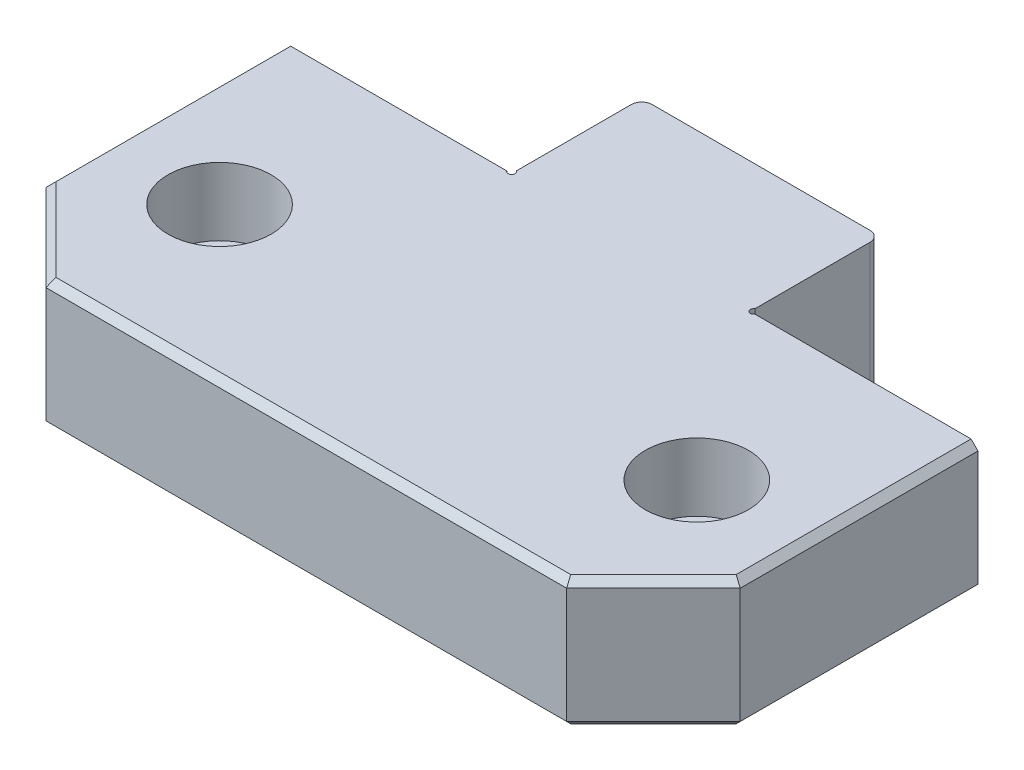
ISO-10303-21;
HEADER;
FILE_DESCRIPTION(('STEP AP214'),'2;1');
FILE_NAME('part.step','',(''),(''),'','','');
FILE_SCHEMA(('AUTOMOTIVE_DESIGN { 1 0 10303 214 1 1 1 1 }'));
ENDSEC;
DATA;
#1=APPLICATION_CONTEXT('core data for automotive mechanical design processes');
#2=APPLICATION_PROTOCOL_DEFINITION('international standard','automotive_design',2000,#1);
#3=PRODUCT_CONTEXT('',#1,'mechanical');
#4=PRODUCT('Part','Part','',(#3));
#5=PRODUCT_RELATED_PRODUCT_CATEGORY('part','',(#4));
#6=PRODUCT_DEFINITION_FORMATION('','',#4);
#7=PRODUCT_DEFINITION_CONTEXT('part definition',#1,'design');
#8=PRODUCT_DEFINITION('design','',#6,#7);
#9=PRODUCT_DEFINITION_SHAPE('','',#8);
#10=(LENGTH_UNIT() NAMED_UNIT(*) SI_UNIT(.MILLI.,.METRE.));
#11=(NAMED_UNIT(*) PLANE_ANGLE_UNIT() SI_UNIT($,.RADIAN.));
#12=(NAMED_UNIT(*) SI_UNIT($,.STERADIAN.) SOLID_ANGLE_UNIT());
#13=UNCERTAINTY_MEASURE_WITH_UNIT(LENGTH_MEASURE(1.E-05),#10,'distance_accuracy_value','');
#14=(GEOMETRIC_REPRESENTATION_CONTEXT(3) GLOBAL_UNCERTAINTY_ASSIGNED_CONTEXT((#13)) GLOBAL_UNIT_ASSIGNED_CONTEXT((#10,
#11,#12)) REPRESENTATION_CONTEXT('',''));
#15=CARTESIAN_POINT('',(0.,0.,0.));
#16=DIRECTION('',(0.,0.,1.));
#17=DIRECTION('',(1.,0.,0.));
#18=AXIS2_PLACEMENT_3D('',#15,#16,#17);
#19=CARTESIAN_POINT('',(-34.925,15.748,25.273));
#20=DIRECTION('',(0.,-1.,0.));
#21=DIRECTION('',(0.,0.,-1.));
#22=AXIS2_PLACEMENT_3D('',#19,#20,#21);
#23=CYLINDRICAL_SURFACE('',#22,5.1562);
#24=CARTESIAN_POINT('',(-34.925,0.,25.273));
#25=DIRECTION('',(0.,-1.,0.));
#26=DIRECTION('',(0.,0.,-1.));
#27=AXIS2_PLACEMENT_3D('',#24,#25,#26);
#28=CIRCLE('',#27,5.1562);
#29=CARTESIAN_POINT('',(-34.925,0.,20.1168));
#30=VERTEX_POINT('',#29);
#31=EDGE_CURVE('E250',#30,#30,#28,.T.);
#32=ORIENTED_EDGE('',*,*,#31,.T.);
#33=EDGE_LOOP('',(#32));
#34=FACE_BOUND('',#33,.T.);
#35=CARTESIAN_POINT('',(-34.925,8.9916,25.273));
#36=DIRECTION('',(0.,1.,0.));
#37=DIRECTION('',(0.,0.,1.));
#38=AXIS2_PLACEMENT_3D('',#35,#36,#37);
#39=CIRCLE('',#38,5.1562);
#40=CARTESIAN_POINT('',(-34.925,8.9916,30.4292));
#41=VERTEX_POINT('',#40);
#42=EDGE_CURVE('E252',#41,#41,#39,.F.);
#43=ORIENTED_EDGE('',*,*,#42,.F.);
#44=EDGE_LOOP('',(#43));
#45=FACE_BOUND('',#44,.T.);
#46=ADVANCED_FACE('F32',(#34,#45),#23,.F.);
#47=CARTESIAN_POINT('',(34.925,15.748,25.273));
#48=DIRECTION('',(0.,-1.,0.));
#49=DIRECTION('',(0.,0.,-1.));
#50=AXIS2_PLACEMENT_3D('',#47,#48,#49);
#51=CYLINDRICAL_SURFACE('',#50,5.1562);
#52=CARTESIAN_POINT('',(34.925,0.,25.273));
#53=DIRECTION('',(0.,-1.,0.));
#54=DIRECTION('',(0.,0.,-1.));
#55=AXIS2_PLACEMENT_3D('',#52,#53,#54);
#56=CIRCLE('',#55,5.1562);
#57=CARTESIAN_POINT('',(34.925,0.,20.1168));
#58=VERTEX_POINT('',#57);
#59=EDGE_CURVE('E210',#58,#58,#56,.T.);
#60=ORIENTED_EDGE('',*,*,#59,.T.);
#61=EDGE_LOOP('',(#60));
#62=FACE_BOUND('',#61,.T.);
#63=CARTESIAN_POINT('',(34.925,8.9916,25.273));
#64=DIRECTION('',(0.,1.,0.));
#65=DIRECTION('',(0.,0.,1.));
#66=AXIS2_PLACEMENT_3D('',#63,#64,#65);
#67=CIRCLE('',#66,5.1562);
#68=CARTESIAN_POINT('',(34.925,8.9916,30.4292));
#69=VERTEX_POINT('',#68);
#70=EDGE_CURVE('E247',#69,#69,#67,.F.);
#71=ORIENTED_EDGE('',*,*,#70,.F.);
#72=EDGE_LOOP('',(#71));
#73=FACE_BOUND('',#72,.T.);
#74=ADVANCED_FACE('F491',(#62,#73),#51,.F.);
#75=CARTESIAN_POINT('',(-50.8,18.923,47.498));
#76=DIRECTION('',(1.,0.,0.));
#77=DIRECTION('',(0.,0.,-1.));
#78=AXIS2_PLACEMENT_3D('',#75,#76,#77);
#79=PLANE('',#78);
#80=DIRECTION('',(0.,1.,0.));
#81=VECTOR('',#80,1.);
#82=CARTESIAN_POINT('',(-50.8,18.923,34.798));
#83=LINE('',#82,#81);
#84=CARTESIAN_POINT('',(-50.8,1.016,34.798));
#85=VERTEX_POINT('',#84);
#86=CARTESIAN_POINT('',(-50.8,17.907,34.798));
#87=VERTEX_POINT('',#86);
#88=EDGE_CURVE('E243',#85,#87,#83,.T.);
#89=ORIENTED_EDGE('',*,*,#88,.T.);
#90=DIRECTION('',(0.,0.,-1.));
#91=VECTOR('',#90,1.);
#92=CARTESIAN_POINT('',(-50.8,17.907,0.));
#93=LINE('',#92,#91);
#94=CARTESIAN_POINT('',(-50.8,17.907,0.));
#95=VERTEX_POINT('',#94);
#96=EDGE_CURVE('E284',#87,#95,#93,.T.);
#97=ORIENTED_EDGE('',*,*,#96,.T.);
#98=DIRECTION('',(0.,-1.,0.));
#99=VECTOR('',#98,1.);
#100=CARTESIAN_POINT('',(-50.8,18.923,0.));
#101=LINE('',#100,#99);
#102=CARTESIAN_POINT('',(-50.8,1.01600000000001,0.));
#103=VERTEX_POINT('',#102);
#104=EDGE_CURVE('E217',#95,#103,#101,.T.);
#105=ORIENTED_EDGE('',*,*,#104,.T.);
#106=DIRECTION('',(0.,0.,1.));
#107=VECTOR('',#106,1.);
#108=CARTESIAN_POINT('',(-50.8,1.016,47.498));
#109=LINE('',#108,#107);
#110=EDGE_CURVE('E281',#103,#85,#109,.T.);
#111=ORIENTED_EDGE('',*,*,#110,.T.);
#112=EDGE_LOOP('',(#89,#97,#105,#111));
#113=FACE_BOUND('',#112,.T.);
#114=ADVANCED_FACE('F388',(#113),#79,.F.);
#115=CARTESIAN_POINT('',(-50.8,18.923,47.498));
#116=DIRECTION('',(0.,0.,-1.));
#117=DIRECTION('',(-1.,0.,0.));
#118=AXIS2_PLACEMENT_3D('',#115,#116,#117);
#119=PLANE('',#118);
#120=DIRECTION('',(0.,1.,0.));
#121=VECTOR('',#120,1.);
#122=CARTESIAN_POINT('',(38.1,18.923,47.498));
#123=LINE('',#122,#121);
#124=CARTESIAN_POINT('',(38.1,1.016,47.498));
#125=VERTEX_POINT('',#124);
#126=CARTESIAN_POINT('',(38.1,17.907,47.498));
#127=VERTEX_POINT('',#126);
#128=EDGE_CURVE('E240',#125,#127,#123,.T.);
#129=ORIENTED_EDGE('',*,*,#128,.T.);
#130=DIRECTION('',(-1.,0.,0.));
#131=VECTOR('',#130,1.);
#132=CARTESIAN_POINT('',(-38.1,17.907,47.498));
#133=LINE('',#132,#131);
#134=CARTESIAN_POINT('',(-38.1,17.907,47.498));
#135=VERTEX_POINT('',#134);
#136=EDGE_CURVE('E308',#127,#135,#133,.T.);
#137=ORIENTED_EDGE('',*,*,#136,.T.);
#138=DIRECTION('',(0.,-1.,0.));
#139=VECTOR('',#138,1.);
#140=CARTESIAN_POINT('',(-38.1,18.923,47.498));
#141=LINE('',#140,#139);
#142=CARTESIAN_POINT('',(-38.1,1.016,47.498));
#143=VERTEX_POINT('',#142);
#144=EDGE_CURVE('E237',#135,#143,#141,.T.);
#145=ORIENTED_EDGE('',*,*,#144,.T.);
#146=DIRECTION('',(1.,0.,0.));
#147=VECTOR('',#146,1.);
#148=CARTESIAN_POINT('',(-50.8,1.016,47.498));
#149=LINE('',#148,#147);
#150=EDGE_CURVE('E306',#143,#125,#149,.T.);
#151=ORIENTED_EDGE('',*,*,#150,.T.);
#152=EDGE_LOOP('',(#129,#137,#145,#151));
#153=FACE_BOUND('',#152,.T.);
#154=ADVANCED_FACE('F367',(#153),#119,.F.);
#155=CARTESIAN_POINT('',(50.8,18.923,47.498));
#156=DIRECTION('',(-1.,0.,0.));
#157=DIRECTION('',(0.,0.,1.));
#158=AXIS2_PLACEMENT_3D('',#155,#156,#157);
#159=PLANE('',#158);
#160=DIRECTION('',(0.,-1.,0.));
#161=VECTOR('',#160,1.);
#162=CARTESIAN_POINT('',(50.8,18.923,0.));
#163=LINE('',#162,#161);
#164=CARTESIAN_POINT('',(50.8,17.907,0.));
#165=VERTEX_POINT('',#164);
#166=CARTESIAN_POINT('',(50.8,1.01600000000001,0.));
#167=VERTEX_POINT('',#166);
#168=EDGE_CURVE('E231',#165,#167,#163,.T.);
#169=ORIENTED_EDGE('',*,*,#168,.F.);
#170=DIRECTION('',(0.,0.,1.));
#171=VECTOR('',#170,1.);
#172=CARTESIAN_POINT('',(50.8,17.907,34.798));
#173=LINE('',#172,#171);
#174=CARTESIAN_POINT('',(50.8,17.907,34.798));
#175=VERTEX_POINT('',#174);
#176=EDGE_CURVE('E300',#165,#175,#173,.T.);
#177=ORIENTED_EDGE('',*,*,#176,.T.);
#178=DIRECTION('',(0.,-1.,0.));
#179=VECTOR('',#178,1.);
#180=CARTESIAN_POINT('',(50.8,18.923,34.798));
#181=LINE('',#180,#179);
#182=CARTESIAN_POINT('',(50.8,1.016,34.798));
#183=VERTEX_POINT('',#182);
#184=EDGE_CURVE('E234',#175,#183,#181,.T.);
#185=ORIENTED_EDGE('',*,*,#184,.T.);
#186=DIRECTION('',(0.,0.,-1.));
#187=VECTOR('',#186,1.);
#188=CARTESIAN_POINT('',(50.8,1.016,47.498));
#189=LINE('',#188,#187);
#190=EDGE_CURVE('E298',#183,#167,#189,.T.);
#191=ORIENTED_EDGE('',*,*,#190,.T.);
#192=EDGE_LOOP('',(#169,#177,#185,#191));
#193=FACE_BOUND('',#192,.T.);
#194=ADVANCED_FACE('F350',(#193),#159,.F.);
#195=CARTESIAN_POINT('',(18.1486919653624,18.923,0.));
#196=DIRECTION('',(0.,0.,1.));
#197=DIRECTION('',(1.,0.,0.));
#198=AXIS2_PLACEMENT_3D('',#195,#196,#197);
#199=PLANE('',#198);
#200=DIRECTION('',(-1.,0.,0.));
#201=VECTOR('',#200,1.);
#202=CARTESIAN_POINT('',(18.1486919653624,18.923,0.));
#203=LINE('',#202,#201);
#204=CARTESIAN_POINT('',(49.784,18.923,0.));
#205=VERTEX_POINT('',#204);
#206=CARTESIAN_POINT('',(18.1486919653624,18.923,0.));
#207=VERTEX_POINT('',#206);
#208=EDGE_CURVE('E216',#205,#207,#203,.T.);
#209=ORIENTED_EDGE('',*,*,#208,.F.);
#210=DIRECTION('',(0.707106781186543,-0.707106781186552,0.));
#211=VECTOR('',#210,1.);
#212=CARTESIAN_POINT('',(49.784,18.923,0.));
#213=LINE('',#212,#211);
#214=EDGE_CURVE('E296',#205,#165,#213,.T.);
#215=ORIENTED_EDGE('',*,*,#214,.T.);
#216=ORIENTED_EDGE('',*,*,#168,.T.);
#217=DIRECTION('',(0.707106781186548,0.707106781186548,0.));
#218=VECTOR('',#217,1.);
#219=CARTESIAN_POINT('',(50.8,1.016,0.));
#220=LINE('',#219,#218);
#221=CARTESIAN_POINT('',(49.784,0.,0.));
#222=VERTEX_POINT('',#221);
#223=EDGE_CURVE('E294',#167,#222,#220,.F.);
#224=ORIENTED_EDGE('',*,*,#223,.T.);
#225=DIRECTION('',(-1.,0.,0.));
#226=VECTOR('',#225,1.);
#227=CARTESIAN_POINT('',(18.1486919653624,0.,0.));
#228=LINE('',#227,#226);
#229=CARTESIAN_POINT('',(18.1486919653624,0.,0.));
#230=VERTEX_POINT('',#229);
#231=EDGE_CURVE('E206',#222,#230,#228,.T.);
#232=ORIENTED_EDGE('',*,*,#231,.T.);
#233=DIRECTION('',(0.,-1.,0.));
#234=VECTOR('',#233,1.);
#235=CARTESIAN_POINT('',(18.1486919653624,18.923,0.));
#236=LINE('',#235,#234);
#237=EDGE_CURVE('E205',#207,#230,#236,.T.);
#238=ORIENTED_EDGE('',*,*,#237,.F.);
#239=EDGE_LOOP('',(#209,#215,#216,#224,#232,#238));
#240=FACE_BOUND('',#239,.T.);
#241=ADVANCED_FACE('F355',(#240),#199,.F.);
#242=CARTESIAN_POINT('',(17.7165,18.923,-0.254));
#243=DIRECTION('',(0.,-1.,0.));
#244=DIRECTION('',(0.,0.,-1.));
#245=AXIS2_PLACEMENT_3D('',#242,#243,#244);
#246=CYLINDRICAL_SURFACE('',#245,0.50130419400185);
#247=CARTESIAN_POINT('',(17.7165,0.,-0.254));
#248=DIRECTION('',(0.,-1.,0.));
#249=DIRECTION('',(0.,0.,1.));
#250=AXIS2_PLACEMENT_3D('',#247,#248,#249);
#251=CIRCLE('',#250,0.50130419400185);
#252=CARTESIAN_POINT('',(17.2843080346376,0.,0.));
#253=VERTEX_POINT('',#252);
#254=EDGE_CURVE('E197',#230,#253,#251,.T.);
#255=ORIENTED_EDGE('',*,*,#254,.T.);
#256=DIRECTION('',(0.,-1.,0.));
#257=VECTOR('',#256,1.);
#258=CARTESIAN_POINT('',(17.2843080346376,18.923,0.));
#259=LINE('',#258,#257);
#260=CARTESIAN_POINT('',(17.2843080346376,0.254000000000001,0.));
#261=VERTEX_POINT('',#260);
#262=EDGE_CURVE('E180',#253,#261,#259,.F.);
#263=ORIENTED_EDGE('',*,*,#262,.T.);
#264=CARTESIAN_POINT('',(17.7165,0.254000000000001,-0.254));
#265=DIRECTION('',(0.,1.,0.));
#266=DIRECTION('',(0.,0.,1.));
#267=AXIS2_PLACEMENT_3D('',#264,#265,#266);
#268=CIRCLE('',#267,0.50130419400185);
#269=CARTESIAN_POINT('',(17.4625,0.254,-0.686191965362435));
#270=VERTEX_POINT('',#269);
#271=EDGE_CURVE('E431',#261,#270,#268,.F.);
#272=ORIENTED_EDGE('',*,*,#271,.T.);
#273=DIRECTION('',(0.,-1.,0.));
#274=VECTOR('',#273,1.);
#275=CARTESIAN_POINT('',(17.4625,18.923,-0.686191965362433));
#276=LINE('',#275,#274);
#277=CARTESIAN_POINT('',(17.4625,18.923,-0.686191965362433));
#278=VERTEX_POINT('',#277);
#279=EDGE_CURVE('E227',#278,#270,#276,.T.);
#280=ORIENTED_EDGE('',*,*,#279,.F.);
#281=CARTESIAN_POINT('',(17.7165,18.923,-0.254));
#282=DIRECTION('',(0.,-1.,0.));
#283=DIRECTION('',(0.,0.,1.));
#284=AXIS2_PLACEMENT_3D('',#281,#282,#283);
#285=CIRCLE('',#284,0.50130419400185);
#286=EDGE_CURVE('E415',#207,#278,#285,.T.);
#287=ORIENTED_EDGE('',*,*,#286,.F.);
#288=ORIENTED_EDGE('',*,*,#237,.T.);
#289=EDGE_LOOP('',(#255,#263,#272,#280,#287,#288));
#290=FACE_BOUND('',#289,.T.);
#291=ADVANCED_FACE('F202',(#290),#246,.F.);
#292=CARTESIAN_POINT('',(17.4625,18.923,-19.05));
#293=DIRECTION('',(-1.,0.,0.));
#294=DIRECTION('',(0.,0.,1.));
#295=AXIS2_PLACEMENT_3D('',#292,#293,#294);
#296=PLANE('',#295);
#297=ORIENTED_EDGE('',*,*,#279,.T.);
#298=DIRECTION('',(0.,0.,1.));
#299=VECTOR('',#298,1.);
#300=CARTESIAN_POINT('',(17.4625,0.254,0.));
#301=LINE('',#300,#299);
#302=CARTESIAN_POINT('',(17.4625,0.254000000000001,-17.526));
#303=VERTEX_POINT('',#302);
#304=EDGE_CURVE('E437',#303,#270,#301,.T.);
#305=ORIENTED_EDGE('',*,*,#304,.F.);
#306=DIRECTION('',(0.,-1.,0.));
#307=VECTOR('',#306,1.);
#308=CARTESIAN_POINT('',(17.4625,18.923,-17.526));
#309=LINE('',#308,#307);
#310=CARTESIAN_POINT('',(17.4625,18.923,-17.526));
#311=VERTEX_POINT('',#310);
#312=EDGE_CURVE('E268',#303,#311,#309,.F.);
#313=ORIENTED_EDGE('',*,*,#312,.T.);
#314=DIRECTION('',(0.,0.,-1.));
#315=VECTOR('',#314,1.);
#316=CARTESIAN_POINT('',(17.4625,18.923,-19.05));
#317=LINE('',#316,#315);
#318=EDGE_CURVE('E412',#278,#311,#317,.T.);
#319=ORIENTED_EDGE('',*,*,#318,.F.);
#320=EDGE_LOOP('',(#297,#305,#313,#319));
#321=FACE_BOUND('',#320,.T.);
#322=ADVANCED_FACE('F468',(#321),#296,.F.);
#323=CARTESIAN_POINT('',(-17.4625,18.923,-19.05));
#324=DIRECTION('',(0.,0.,1.));
#325=DIRECTION('',(1.,0.,0.));
#326=AXIS2_PLACEMENT_3D('',#323,#324,#325);
#327=PLANE('',#326);
#328=DIRECTION('',(0.,-1.,0.));
#329=VECTOR('',#328,1.);
#330=CARTESIAN_POINT('',(15.9385,18.923,-19.05));
#331=LINE('',#330,#329);
#332=CARTESIAN_POINT('',(15.9385,18.923,-19.05));
#333=VERTEX_POINT('',#332);
#334=CARTESIAN_POINT('',(15.9385,0.254000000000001,-19.05));
#335=VERTEX_POINT('',#334);
#336=EDGE_CURVE('E259',#333,#335,#331,.T.);
#337=ORIENTED_EDGE('',*,*,#336,.T.);
#338=DIRECTION('',(1.,0.,0.));
#339=VECTOR('',#338,1.);
#340=CARTESIAN_POINT('',(17.4625,0.254,-19.05));
#341=LINE('',#340,#339);
#342=CARTESIAN_POINT('',(-15.9385,0.254000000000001,-19.05));
#343=VERTEX_POINT('',#342);
#344=EDGE_CURVE('E46',#343,#335,#341,.T.);
#345=ORIENTED_EDGE('',*,*,#344,.F.);
#346=DIRECTION('',(0.,-1.,0.));
#347=VECTOR('',#346,1.);
#348=CARTESIAN_POINT('',(-15.9385,18.923,-19.05));
#349=LINE('',#348,#347);
#350=CARTESIAN_POINT('',(-15.9385,18.923,-19.05));
#351=VERTEX_POINT('',#350);
#352=EDGE_CURVE('E262',#343,#351,#349,.F.);
#353=ORIENTED_EDGE('',*,*,#352,.T.);
#354=DIRECTION('',(-1.,0.,0.));
#355=VECTOR('',#354,1.);
#356=CARTESIAN_POINT('',(-17.4625,18.923,-19.05));
#357=LINE('',#356,#355);
#358=EDGE_CURVE('E409',#333,#351,#357,.T.);
#359=ORIENTED_EDGE('',*,*,#358,.F.);
#360=EDGE_LOOP('',(#337,#345,#353,#359));
#361=FACE_BOUND('',#360,.T.);
#362=ADVANCED_FACE('F459',(#361),#327,.F.);
#363=CARTESIAN_POINT('',(-17.4625,18.923,-0.693940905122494));
#364=DIRECTION('',(1.,0.,0.));
#365=DIRECTION('',(0.,0.,-1.));
#366=AXIS2_PLACEMENT_3D('',#363,#364,#365);
#367=PLANE('',#366);
#368=DIRECTION('',(0.,-1.,0.));
#369=VECTOR('',#368,1.);
#370=CARTESIAN_POINT('',(-17.4625,18.923,-17.526));
#371=LINE('',#370,#369);
#372=CARTESIAN_POINT('',(-17.4625,18.923,-17.526));
#373=VERTEX_POINT('',#372);
#374=CARTESIAN_POINT('',(-17.4625,0.254000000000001,-17.526));
#375=VERTEX_POINT('',#374);
#376=EDGE_CURVE('E246',#373,#375,#371,.T.);
#377=ORIENTED_EDGE('',*,*,#376,.T.);
#378=DIRECTION('',(0.,0.,-1.));
#379=VECTOR('',#378,1.);
#380=CARTESIAN_POINT('',(-17.4625,0.254,-19.05));
#381=LINE('',#380,#379);
#382=CARTESIAN_POINT('',(-17.4625,0.254000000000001,-0.693940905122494));
#383=VERTEX_POINT('',#382);
#384=EDGE_CURVE('E441',#383,#375,#381,.T.);
#385=ORIENTED_EDGE('',*,*,#384,.F.);
#386=DIRECTION('',(0.,-1.,0.));
#387=VECTOR('',#386,1.);
#388=CARTESIAN_POINT('',(-17.4625,18.923,-0.693940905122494));
#389=LINE('',#388,#387);
#390=CARTESIAN_POINT('',(-17.4625,18.923,-0.693940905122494));
#391=VERTEX_POINT('',#390);
#392=EDGE_CURVE('E224',#391,#383,#389,.T.);
#393=ORIENTED_EDGE('',*,*,#392,.F.);
#394=DIRECTION('',(0.,0.,1.));
#395=VECTOR('',#394,1.);
#396=CARTESIAN_POINT('',(-17.4625,18.923,-0.693940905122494));
#397=LINE('',#396,#395);
#398=EDGE_CURVE('E405',#373,#391,#397,.T.);
#399=ORIENTED_EDGE('',*,*,#398,.F.);
#400=EDGE_LOOP('',(#377,#385,#393,#399));
#401=FACE_BOUND('',#400,.T.);
#402=ADVANCED_FACE('F450',(#401),#367,.F.);
#403=CARTESIAN_POINT('',(-17.7165,18.923,-0.254));
#404=DIRECTION('',(0.,-1.,0.));
#405=DIRECTION('',(0.,0.,-1.));
#406=AXIS2_PLACEMENT_3D('',#403,#404,#405);
#407=CYLINDRICAL_SURFACE('',#406,0.508);
#408=CARTESIAN_POINT('',(-17.7165,0.254000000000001,-0.254));
#409=DIRECTION('',(0.,1.,0.));
#410=DIRECTION('',(0.,0.,1.));
#411=AXIS2_PLACEMENT_3D('',#408,#409,#410);
#412=CIRCLE('',#411,0.508);
#413=CARTESIAN_POINT('',(-17.2765590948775,0.254000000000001,0.));
#414=VERTEX_POINT('',#413);
#415=EDGE_CURVE('E433',#383,#414,#412,.F.);
#416=ORIENTED_EDGE('',*,*,#415,.T.);
#417=DIRECTION('',(0.,-1.,0.));
#418=VECTOR('',#417,1.);
#419=CARTESIAN_POINT('',(-17.2765590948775,18.923,0.));
#420=LINE('',#419,#418);
#421=CARTESIAN_POINT('',(-17.2765590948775,0.,0.));
#422=VERTEX_POINT('',#421);
#423=EDGE_CURVE('E191',#414,#422,#420,.T.);
#424=ORIENTED_EDGE('',*,*,#423,.T.);
#425=CARTESIAN_POINT('',(-17.7165,0.,-0.254));
#426=DIRECTION('',(0.,-1.,0.));
#427=DIRECTION('',(0.,0.,1.));
#428=AXIS2_PLACEMENT_3D('',#425,#426,#427);
#429=CIRCLE('',#428,0.508);
#430=CARTESIAN_POINT('',(-18.1564409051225,0.,0.));
#431=VERTEX_POINT('',#430);
#432=EDGE_CURVE('E199',#422,#431,#429,.T.);
#433=ORIENTED_EDGE('',*,*,#432,.T.);
#434=DIRECTION('',(0.,-1.,0.));
#435=VECTOR('',#434,1.);
#436=CARTESIAN_POINT('',(-18.1564409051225,18.923,0.));
#437=LINE('',#436,#435);
#438=CARTESIAN_POINT('',(-18.1564409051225,18.923,0.));
#439=VERTEX_POINT('',#438);
#440=EDGE_CURVE('E220',#439,#431,#437,.T.);
#441=ORIENTED_EDGE('',*,*,#440,.F.);
#442=CARTESIAN_POINT('',(-17.7165,18.923,-0.254));
#443=DIRECTION('',(0.,-1.,0.));
#444=DIRECTION('',(0.,0.,1.));
#445=AXIS2_PLACEMENT_3D('',#442,#443,#444);
#446=CIRCLE('',#445,0.508);
#447=EDGE_CURVE('E403',#391,#439,#446,.T.);
#448=ORIENTED_EDGE('',*,*,#447,.F.);
#449=ORIENTED_EDGE('',*,*,#392,.T.);
#450=EDGE_LOOP('',(#416,#424,#433,#441,#448,#449));
#451=FACE_BOUND('',#450,.T.);
#452=ADVANCED_FACE('F446',(#451),#407,.F.);
#453=CARTESIAN_POINT('',(-50.8,18.923,0.));
#454=DIRECTION('',(0.,0.,1.));
#455=DIRECTION('',(1.,0.,0.));
#456=AXIS2_PLACEMENT_3D('',#453,#454,#455);
#457=PLANE('',#456);
#458=ORIENTED_EDGE('',*,*,#104,.F.);
#459=DIRECTION('',(0.707106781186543,0.707106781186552,0.));
#460=VECTOR('',#459,1.);
#461=CARTESIAN_POINT('',(-49.784,18.923,0.));
#462=LINE('',#461,#460);
#463=CARTESIAN_POINT('',(-49.784,18.923,0.));
#464=VERTEX_POINT('',#463);
#465=EDGE_CURVE('E288',#95,#464,#462,.T.);
#466=ORIENTED_EDGE('',*,*,#465,.T.);
#467=DIRECTION('',(-1.,0.,0.));
#468=VECTOR('',#467,1.);
#469=CARTESIAN_POINT('',(-50.8,18.923,0.));
#470=LINE('',#469,#468);
#471=EDGE_CURVE('E221',#439,#464,#470,.T.);
#472=ORIENTED_EDGE('',*,*,#471,.F.);
#473=ORIENTED_EDGE('',*,*,#440,.T.);
#474=DIRECTION('',(-1.,0.,0.));
#475=VECTOR('',#474,1.);
#476=CARTESIAN_POINT('',(-50.8,0.,0.));
#477=LINE('',#476,#475);
#478=CARTESIAN_POINT('',(-49.784,0.,0.));
#479=VERTEX_POINT('',#478);
#480=EDGE_CURVE('E208',#431,#479,#477,.T.);
#481=ORIENTED_EDGE('',*,*,#480,.T.);
#482=DIRECTION('',(0.707106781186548,-0.707106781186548,0.));
#483=VECTOR('',#482,1.);
#484=CARTESIAN_POINT('',(-50.8,1.016,0.));
#485=LINE('',#484,#483);
#486=EDGE_CURVE('E286',#479,#103,#485,.F.);
#487=ORIENTED_EDGE('',*,*,#486,.T.);
#488=EDGE_LOOP('',(#458,#466,#472,#473,#481,#487));
#489=FACE_BOUND('',#488,.T.);
#490=ADVANCED_FACE('F398',(#489),#457,.F.);
#491=CARTESIAN_POINT('',(-17.7165,18.923,-0.254));
#492=DIRECTION('',(0.,1.,0.));
#493=DIRECTION('',(0.,0.,1.));
#494=AXIS2_PLACEMENT_3D('',#491,#492,#493);
#495=PLANE('',#494);
#496=ORIENTED_EDGE('',*,*,#471,.T.);
#497=DIRECTION('',(0.,0.,1.));
#498=VECTOR('',#497,1.);
#499=CARTESIAN_POINT('',(-49.784,18.923,34.7979999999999));
#500=LINE('',#499,#498);
#501=CARTESIAN_POINT('',(-49.784,18.923,34.3771590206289));
#502=VERTEX_POINT('',#501);
#503=EDGE_CURVE('E278',#464,#502,#500,.T.);
#504=ORIENTED_EDGE('',*,*,#503,.T.);
#505=DIRECTION('',(0.707106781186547,0.,0.707106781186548));
#506=VECTOR('',#505,1.);
#507=CARTESIAN_POINT('',(-51.0658295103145,18.923,33.0953295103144));
#508=LINE('',#507,#506);
#509=CARTESIAN_POINT('',(-37.6791590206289,18.923,46.482));
#510=VERTEX_POINT('',#509);
#511=EDGE_CURVE('E276',#502,#510,#508,.T.);
#512=ORIENTED_EDGE('',*,*,#511,.T.);
#513=DIRECTION('',(1.,0.,0.));
#514=VECTOR('',#513,1.);
#515=CARTESIAN_POINT('',(38.0999999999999,18.923,46.482));
#516=LINE('',#515,#514);
#517=CARTESIAN_POINT('',(37.6791590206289,18.923,46.482));
#518=VERTEX_POINT('',#517);
#519=EDGE_CURVE('E270',#510,#518,#516,.T.);
#520=ORIENTED_EDGE('',*,*,#519,.T.);
#521=DIRECTION('',(0.707106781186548,0.,-0.707106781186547));
#522=VECTOR('',#521,1.);
#523=CARTESIAN_POINT('',(33.3493295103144,18.923,50.8118295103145));
#524=LINE('',#523,#522);
#525=CARTESIAN_POINT('',(49.784,18.923,34.3771590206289));
#526=VERTEX_POINT('',#525);
#527=EDGE_CURVE('E272',#518,#526,#524,.T.);
#528=ORIENTED_EDGE('',*,*,#527,.T.);
#529=DIRECTION('',(0.,0.,-1.));
#530=VECTOR('',#529,1.);
#531=CARTESIAN_POINT('',(49.784,18.923,0.));
#532=LINE('',#531,#530);
#533=EDGE_CURVE('E274',#526,#205,#532,.T.);
#534=ORIENTED_EDGE('',*,*,#533,.T.);
#535=ORIENTED_EDGE('',*,*,#208,.T.);
#536=ORIENTED_EDGE('',*,*,#286,.T.);
#537=ORIENTED_EDGE('',*,*,#318,.T.);
#538=CARTESIAN_POINT('',(15.9385,18.923,-17.526));
#539=DIRECTION('',(0.,1.,0.));
#540=DIRECTION('',(0.,0.,1.));
#541=AXIS2_PLACEMENT_3D('',#538,#539,#540);
#542=CIRCLE('',#541,1.524);
#543=EDGE_CURVE('E264',#311,#333,#542,.T.);
#544=ORIENTED_EDGE('',*,*,#543,.T.);
#545=ORIENTED_EDGE('',*,*,#358,.T.);
#546=CARTESIAN_POINT('',(-15.9385,18.923,-17.526));
#547=DIRECTION('',(0.,1.,0.));
#548=DIRECTION('',(0.,0.,1.));
#549=AXIS2_PLACEMENT_3D('',#546,#547,#548);
#550=CIRCLE('',#549,1.524);
#551=EDGE_CURVE('E266',#351,#373,#550,.T.);
#552=ORIENTED_EDGE('',*,*,#551,.T.);
#553=ORIENTED_EDGE('',*,*,#398,.T.);
#554=ORIENTED_EDGE('',*,*,#447,.T.);
#555=EDGE_LOOP('',(#496,#504,#512,#520,#528,#534,#535,#536,#537,#544,#545,#552,#553,#554));
#556=FACE_BOUND('',#555,.T.);
#557=CARTESIAN_POINT('',(-34.925,18.923,25.273));
#558=DIRECTION('',(0.,1.,0.));
#559=DIRECTION('',(0.,0.,1.));
#560=AXIS2_PLACEMENT_3D('',#557,#558,#559);
#561=CIRCLE('',#560,7.5438);
#562=CARTESIAN_POINT('',(-34.925,18.923,32.8168));
#563=VERTEX_POINT('',#562);
#564=EDGE_CURVE('E330',#563,#563,#561,.T.);
#565=ORIENTED_EDGE('',*,*,#564,.F.);
#566=EDGE_LOOP('',(#565));
#567=FACE_BOUND('',#566,.T.);
#568=CARTESIAN_POINT('',(34.925,18.923,25.273));
#569=DIRECTION('',(0.,1.,0.));
#570=DIRECTION('',(0.,0.,1.));
#571=AXIS2_PLACEMENT_3D('',#568,#569,#570);
#572=CIRCLE('',#571,7.54380000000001);
#573=CARTESIAN_POINT('',(34.925,18.923,32.8168));
#574=VERTEX_POINT('',#573);
#575=EDGE_CURVE('E255',#574,#574,#572,.T.);
#576=ORIENTED_EDGE('',*,*,#575,.F.);
#577=EDGE_LOOP('',(#576));
#578=FACE_BOUND('',#577,.T.);
#579=ADVANCED_FACE('F400',(#556,#567,#578),#495,.T.);
#580=CARTESIAN_POINT('',(-17.7165,0.,-0.254));
#581=DIRECTION('',(0.,1.,0.));
#582=DIRECTION('',(0.,0.,1.));
#583=AXIS2_PLACEMENT_3D('',#580,#581,#582);
#584=PLANE('',#583);
#585=ORIENTED_EDGE('',*,*,#31,.F.);
#586=EDGE_LOOP('',(#585));
#587=FACE_BOUND('',#586,.T.);
#588=ORIENTED_EDGE('',*,*,#59,.F.);
#589=EDGE_LOOP('',(#588));
#590=FACE_BOUND('',#589,.T.);
#591=ORIENTED_EDGE('',*,*,#432,.F.);
#592=DIRECTION('',(-1.,0.,0.));
#593=VECTOR('',#592,1.);
#594=CARTESIAN_POINT('',(17.4625,0.,0.));
#595=LINE('',#594,#593);
#596=EDGE_CURVE('E183',#253,#422,#595,.T.);
#597=ORIENTED_EDGE('',*,*,#596,.F.);
#598=ORIENTED_EDGE('',*,*,#254,.F.);
#599=ORIENTED_EDGE('',*,*,#231,.F.);
#600=DIRECTION('',(0.,0.,1.));
#601=VECTOR('',#600,1.);
#602=CARTESIAN_POINT('',(49.784,0.,-0.254));
#603=LINE('',#602,#601);
#604=CARTESIAN_POINT('',(49.784,0.,34.3771590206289));
#605=VERTEX_POINT('',#604);
#606=EDGE_CURVE('E310',#222,#605,#603,.T.);
#607=ORIENTED_EDGE('',*,*,#606,.T.);
#608=DIRECTION('',(-0.707106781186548,0.,0.707106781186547));
#609=VECTOR('',#608,1.);
#610=CARTESIAN_POINT('',(37.3815795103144,0.,46.7795795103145));
#611=LINE('',#610,#609);
#612=CARTESIAN_POINT('',(37.6791590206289,0.,46.482));
#613=VERTEX_POINT('',#612);
#614=EDGE_CURVE('E312',#605,#613,#611,.T.);
#615=ORIENTED_EDGE('',*,*,#614,.T.);
#616=DIRECTION('',(-1.,0.,0.));
#617=VECTOR('',#616,1.);
#618=CARTESIAN_POINT('',(-17.7165,0.,46.482));
#619=LINE('',#618,#617);
#620=CARTESIAN_POINT('',(-37.6791590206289,0.,46.482));
#621=VERTEX_POINT('',#620);
#622=EDGE_CURVE('E314',#613,#621,#619,.T.);
#623=ORIENTED_EDGE('',*,*,#622,.T.);
#624=DIRECTION('',(-0.707106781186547,0.,-0.707106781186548));
#625=VECTOR('',#624,1.);
#626=CARTESIAN_POINT('',(-50.0815795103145,0.,34.0795795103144));
#627=LINE('',#626,#625);
#628=CARTESIAN_POINT('',(-49.784,0.,34.3771590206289));
#629=VERTEX_POINT('',#628);
#630=EDGE_CURVE('E54',#621,#629,#627,.T.);
#631=ORIENTED_EDGE('',*,*,#630,.T.);
#632=DIRECTION('',(0.,0.,-1.));
#633=VECTOR('',#632,1.);
#634=CARTESIAN_POINT('',(-49.784,0.,-0.254));
#635=LINE('',#634,#633);
#636=EDGE_CURVE('E40',#629,#479,#635,.T.);
#637=ORIENTED_EDGE('',*,*,#636,.T.);
#638=ORIENTED_EDGE('',*,*,#480,.F.);
#639=EDGE_LOOP('',(#591,#597,#598,#599,#607,#615,#623,#631,#637,#638));
#640=FACE_BOUND('',#639,.T.);
#641=ADVANCED_FACE('F195',(#587,#590,#640),#584,.F.);
#642=CARTESIAN_POINT('',(50.8,18.923,34.798));
#643=DIRECTION('',(-0.707106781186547,0.,-0.707106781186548));
#644=DIRECTION('',(-0.707106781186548,0.,0.707106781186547));
#645=AXIS2_PLACEMENT_3D('',#642,#643,#644);
#646=PLANE('',#645);
#647=ORIENTED_EDGE('',*,*,#184,.F.);
#648=DIRECTION('',(0.707106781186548,0.,-0.707106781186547));
#649=VECTOR('',#648,1.);
#650=CARTESIAN_POINT('',(50.8,17.907,34.798));
#651=LINE('',#650,#649);
#652=EDGE_CURVE('E304',#175,#127,#651,.F.);
#653=ORIENTED_EDGE('',*,*,#652,.T.);
#654=ORIENTED_EDGE('',*,*,#128,.F.);
#655=DIRECTION('',(-0.707106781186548,0.,0.707106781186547));
#656=VECTOR('',#655,1.);
#657=CARTESIAN_POINT('',(50.8,1.016,34.798));
#658=LINE('',#657,#656);
#659=EDGE_CURVE('E302',#125,#183,#658,.F.);
#660=ORIENTED_EDGE('',*,*,#659,.T.);
#661=EDGE_LOOP('',(#647,#653,#654,#660));
#662=FACE_BOUND('',#661,.T.);
#663=ADVANCED_FACE('F363',(#662),#646,.F.);
#664=CARTESIAN_POINT('',(-38.1,18.923,47.498));
#665=DIRECTION('',(0.707106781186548,0.,-0.707106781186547));
#666=DIRECTION('',(-0.707106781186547,0.,-0.707106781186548));
#667=AXIS2_PLACEMENT_3D('',#664,#665,#666);
#668=PLANE('',#667);
#669=ORIENTED_EDGE('',*,*,#144,.F.);
#670=DIRECTION('',(0.707106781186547,0.,0.707106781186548));
#671=VECTOR('',#670,1.);
#672=CARTESIAN_POINT('',(-38.1,17.907,47.498));
#673=LINE('',#672,#671);
#674=EDGE_CURVE('E292',#135,#87,#673,.F.);
#675=ORIENTED_EDGE('',*,*,#674,.T.);
#676=ORIENTED_EDGE('',*,*,#88,.F.);
#677=DIRECTION('',(-0.707106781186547,0.,-0.707106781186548));
#678=VECTOR('',#677,1.);
#679=CARTESIAN_POINT('',(-38.1,1.016,47.498));
#680=LINE('',#679,#678);
#681=EDGE_CURVE('E290',#85,#143,#680,.F.);
#682=ORIENTED_EDGE('',*,*,#681,.T.);
#683=EDGE_LOOP('',(#669,#675,#676,#682));
#684=FACE_BOUND('',#683,.T.);
#685=ADVANCED_FACE('F385',(#684),#668,.F.);
#686=CARTESIAN_POINT('',(34.925,8.9916,25.273));
#687=DIRECTION('',(0.,1.,0.));
#688=DIRECTION('',(0.,0.,1.));
#689=AXIS2_PLACEMENT_3D('',#686,#687,#688);
#690=PLANE('',#689);
#691=CARTESIAN_POINT('',(34.925,8.9916,25.273));
#692=DIRECTION('',(0.,1.,0.));
#693=DIRECTION('',(0.,0.,1.));
#694=AXIS2_PLACEMENT_3D('',#691,#692,#693);
#695=CIRCLE('',#694,7.54380000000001);
#696=CARTESIAN_POINT('',(34.925,8.9916,32.8168));
#697=VERTEX_POINT('',#696);
#698=EDGE_CURVE('E251',#697,#697,#695,.T.);
#699=ORIENTED_EDGE('',*,*,#698,.T.);
#700=EDGE_LOOP('',(#699));
#701=FACE_BOUND('',#700,.T.);
#702=ORIENTED_EDGE('',*,*,#70,.T.);
#703=EDGE_LOOP('',(#702));
#704=FACE_BOUND('',#703,.T.);
#705=ADVANCED_FACE('F533',(#701,#704),#690,.T.);
#706=CARTESIAN_POINT('',(34.925,8.9916,25.273));
#707=DIRECTION('',(0.,1.,0.));
#708=DIRECTION('',(0.,0.,1.));
#709=AXIS2_PLACEMENT_3D('',#706,#707,#708);
#710=CYLINDRICAL_SURFACE('',#709,7.54380000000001);
#711=ORIENTED_EDGE('',*,*,#698,.F.);
#712=EDGE_LOOP('',(#711));
#713=FACE_BOUND('',#712,.T.);
#714=ORIENTED_EDGE('',*,*,#575,.T.);
#715=EDGE_LOOP('',(#714));
#716=FACE_BOUND('',#715,.T.);
#717=ADVANCED_FACE('F501',(#713,#716),#710,.F.);
#718=CARTESIAN_POINT('',(-34.925,8.9916,25.273));
#719=DIRECTION('',(0.,1.,0.));
#720=DIRECTION('',(0.,0.,1.));
#721=AXIS2_PLACEMENT_3D('',#718,#719,#720);
#722=PLANE('',#721);
#723=CARTESIAN_POINT('',(-34.925,8.9916,25.273));
#724=DIRECTION('',(0.,1.,0.));
#725=DIRECTION('',(0.,0.,1.));
#726=AXIS2_PLACEMENT_3D('',#723,#724,#725);
#727=CIRCLE('',#726,7.5438);
#728=CARTESIAN_POINT('',(-34.925,8.9916,32.8168));
#729=VERTEX_POINT('',#728);
#730=EDGE_CURVE('E256',#729,#729,#727,.T.);
#731=ORIENTED_EDGE('',*,*,#730,.T.);
#732=EDGE_LOOP('',(#731));
#733=FACE_BOUND('',#732,.T.);
#734=ORIENTED_EDGE('',*,*,#42,.T.);
#735=EDGE_LOOP('',(#734));
#736=FACE_BOUND('',#735,.T.);
#737=ADVANCED_FACE('F663',(#733,#736),#722,.T.);
#738=CARTESIAN_POINT('',(-34.925,8.9916,25.273));
#739=DIRECTION('',(0.,1.,0.));
#740=DIRECTION('',(0.,0.,1.));
#741=AXIS2_PLACEMENT_3D('',#738,#739,#740);
#742=CYLINDRICAL_SURFACE('',#741,7.5438);
#743=ORIENTED_EDGE('',*,*,#730,.F.);
#744=EDGE_LOOP('',(#743));
#745=FACE_BOUND('',#744,.T.);
#746=ORIENTED_EDGE('',*,*,#564,.T.);
#747=EDGE_LOOP('',(#746));
#748=FACE_BOUND('',#747,.T.);
#749=ADVANCED_FACE('F536',(#745,#748),#742,.F.);
#750=CARTESIAN_POINT('',(-15.9385,18.923,-17.526));
#751=DIRECTION('',(0.,-1.,0.));
#752=DIRECTION('',(0.,0.,-1.));
#753=AXIS2_PLACEMENT_3D('',#750,#751,#752);
#754=CYLINDRICAL_SURFACE('',#753,1.524);
#755=CARTESIAN_POINT('',(-15.9385,0.254000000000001,-17.526));
#756=DIRECTION('',(0.,1.,0.));
#757=DIRECTION('',(0.,0.,1.));
#758=AXIS2_PLACEMENT_3D('',#755,#756,#757);
#759=CIRCLE('',#758,1.524);
#760=EDGE_CURVE('E436',#375,#343,#759,.F.);
#761=ORIENTED_EDGE('',*,*,#760,.F.);
#762=ORIENTED_EDGE('',*,*,#376,.F.);
#763=ORIENTED_EDGE('',*,*,#551,.F.);
#764=ORIENTED_EDGE('',*,*,#352,.F.);
#765=EDGE_LOOP('',(#761,#762,#763,#764));
#766=FACE_BOUND('',#765,.T.);
#767=ADVANCED_FACE('F455',(#766),#754,.T.);
#768=CARTESIAN_POINT('',(15.9385,18.923,-17.526));
#769=DIRECTION('',(0.,-1.,0.));
#770=DIRECTION('',(0.,0.,-1.));
#771=AXIS2_PLACEMENT_3D('',#768,#769,#770);
#772=CYLINDRICAL_SURFACE('',#771,1.524);
#773=CARTESIAN_POINT('',(15.9385,0.254000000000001,-17.526));
#774=DIRECTION('',(0.,1.,0.));
#775=DIRECTION('',(0.,0.,1.));
#776=AXIS2_PLACEMENT_3D('',#773,#774,#775);
#777=CIRCLE('',#776,1.524);
#778=EDGE_CURVE('E11',#335,#303,#777,.F.);
#779=ORIENTED_EDGE('',*,*,#778,.F.);
#780=ORIENTED_EDGE('',*,*,#336,.F.);
#781=ORIENTED_EDGE('',*,*,#543,.F.);
#782=ORIENTED_EDGE('',*,*,#312,.F.);
#783=EDGE_LOOP('',(#779,#780,#781,#782));
#784=FACE_BOUND('',#783,.T.);
#785=ADVANCED_FACE('F465',(#784),#772,.T.);
#786=CARTESIAN_POINT('',(49.784,18.923,-0.254));
#787=DIRECTION('',(0.707106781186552,0.707106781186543,0.));
#788=DIRECTION('',(-0.707106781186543,0.707106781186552,0.));
#789=AXIS2_PLACEMENT_3D('',#786,#787,#788);
#790=PLANE('',#789);
#791=ORIENTED_EDGE('',*,*,#214,.F.);
#792=ORIENTED_EDGE('',*,*,#533,.F.);
#793=DIRECTION('',(-0.678598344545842,0.678598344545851,-0.281084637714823));
#794=VECTOR('',#793,1.);
#795=CARTESIAN_POINT('',(45.350712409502,23.356287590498,32.5408311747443));
#796=LINE('',#795,#794);
#797=EDGE_CURVE('E327',#175,#526,#796,.T.);
#798=ORIENTED_EDGE('',*,*,#797,.F.);
#799=ORIENTED_EDGE('',*,*,#176,.F.);
#800=EDGE_LOOP('',(#791,#792,#798,#799));
#801=FACE_BOUND('',#800,.T.);
#802=ADVANCED_FACE('F359',(#801),#790,.T.);
#803=CARTESIAN_POINT('',(33.3493295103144,18.923,50.8118295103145));
#804=DIRECTION('',(0.500000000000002,0.707106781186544,0.500000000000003));
#805=DIRECTION('',(0.,-0.57735026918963,0.816496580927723));
#806=AXIS2_PLACEMENT_3D('',#803,#804,#805);
#807=PLANE('',#806);
#808=ORIENTED_EDGE('',*,*,#797,.T.);
#809=ORIENTED_EDGE('',*,*,#527,.F.);
#810=DIRECTION('',(-0.281084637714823,0.678598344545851,-0.678598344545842));
#811=VECTOR('',#810,1.);
#812=CARTESIAN_POINT('',(33.3024270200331,29.4893657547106,35.9156342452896));
#813=LINE('',#812,#811);
#814=EDGE_CURVE('E324',#127,#518,#813,.T.);
#815=ORIENTED_EDGE('',*,*,#814,.F.);
#816=ORIENTED_EDGE('',*,*,#652,.F.);
#817=EDGE_LOOP('',(#808,#809,#815,#816));
#818=FACE_BOUND('',#817,.T.);
#819=ADVANCED_FACE('F373',(#818),#807,.T.);
#820=CARTESIAN_POINT('',(-17.7165,18.923,46.482));
#821=DIRECTION('',(0.,0.707106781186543,0.707106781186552));
#822=DIRECTION('',(0.,-0.707106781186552,0.707106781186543));
#823=AXIS2_PLACEMENT_3D('',#820,#821,#822);
#824=PLANE('',#823);
#825=ORIENTED_EDGE('',*,*,#814,.T.);
#826=ORIENTED_EDGE('',*,*,#519,.F.);
#827=DIRECTION('',(-0.281084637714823,-0.678598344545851,0.678598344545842));
#828=VECTOR('',#827,1.);
#829=CARTESIAN_POINT('',(-36.1019378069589,22.7307488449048,42.6742511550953));
#830=LINE('',#829,#828);
#831=EDGE_CURVE('E320',#135,#510,#830,.F.);
#832=ORIENTED_EDGE('',*,*,#831,.F.);
#833=ORIENTED_EDGE('',*,*,#136,.F.);
#834=EDGE_LOOP('',(#825,#826,#832,#833));
#835=FACE_BOUND('',#834,.T.);
#836=ADVANCED_FACE('F377',(#835),#824,.T.);
#837=CARTESIAN_POINT('',(-51.0658295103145,18.923,33.0953295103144));
#838=DIRECTION('',(-0.500000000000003,0.707106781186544,0.500000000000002));
#839=DIRECTION('',(-0.816496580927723,-0.57735026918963,0.));
#840=AXIS2_PLACEMENT_3D('',#837,#838,#839);
#841=PLANE('',#840);
#842=ORIENTED_EDGE('',*,*,#831,.T.);
#843=ORIENTED_EDGE('',*,*,#511,.F.);
#844=DIRECTION('',(-0.678598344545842,-0.678598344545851,0.281084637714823));
#845=VECTOR('',#844,1.);
#846=CARTESIAN_POINT('',(-50.1297762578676,18.5772237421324,34.5203842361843));
#847=LINE('',#846,#845);
#848=EDGE_CURVE('E318',#87,#502,#847,.F.);
#849=ORIENTED_EDGE('',*,*,#848,.F.);
#850=ORIENTED_EDGE('',*,*,#674,.F.);
#851=EDGE_LOOP('',(#842,#843,#849,#850));
#852=FACE_BOUND('',#851,.T.);
#853=ADVANCED_FACE('F382',(#852),#841,.T.);
#854=CARTESIAN_POINT('',(-49.784,18.923,-0.254));
#855=DIRECTION('',(-0.707106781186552,0.707106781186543,0.));
#856=DIRECTION('',(-0.707106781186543,-0.707106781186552,0.));
#857=AXIS2_PLACEMENT_3D('',#854,#855,#856);
#858=PLANE('',#857);
#859=ORIENTED_EDGE('',*,*,#465,.F.);
#860=ORIENTED_EDGE('',*,*,#96,.F.);
#861=ORIENTED_EDGE('',*,*,#848,.T.);
#862=ORIENTED_EDGE('',*,*,#503,.F.);
#863=EDGE_LOOP('',(#859,#860,#861,#862));
#864=FACE_BOUND('',#863,.T.);
#865=ADVANCED_FACE('F393',(#864),#858,.T.);
#866=CARTESIAN_POINT('',(50.8,1.016,47.498));
#867=DIRECTION('',(-0.707106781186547,0.707106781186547,0.));
#868=DIRECTION('',(-0.707106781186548,-0.707106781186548,0.));
#869=AXIS2_PLACEMENT_3D('',#866,#867,#868);
#870=PLANE('',#869);
#871=ORIENTED_EDGE('',*,*,#223,.F.);
#872=ORIENTED_EDGE('',*,*,#190,.F.);
#873=DIRECTION('',(-0.678598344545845,-0.678598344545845,-0.28108463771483));
#874=VECTOR('',#873,1.);
#875=CARTESIAN_POINT('',(53.222443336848,3.43844333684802,35.8014088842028));
#876=LINE('',#875,#874);
#877=EDGE_CURVE('E321',#605,#183,#876,.F.);
#878=ORIENTED_EDGE('',*,*,#877,.F.);
#879=ORIENTED_EDGE('',*,*,#606,.F.);
#880=EDGE_LOOP('',(#871,#872,#878,#879));
#881=FACE_BOUND('',#880,.T.);
#882=ADVANCED_FACE('F34',(#881),#870,.F.);
#883=CARTESIAN_POINT('',(33.3493295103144,0.,50.8118295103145));
#884=DIRECTION('',(-0.499999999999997,0.707106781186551,-0.499999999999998));
#885=DIRECTION('',(0.,0.577350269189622,0.816496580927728));
#886=AXIS2_PLACEMENT_3D('',#883,#884,#885);
#887=PLANE('',#886);
#888=ORIENTED_EDGE('',*,*,#877,.T.);
#889=ORIENTED_EDGE('',*,*,#659,.F.);
#890=DIRECTION('',(-0.281084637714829,-0.678598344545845,-0.678598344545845));
#891=VECTOR('',#890,1.);
#892=CARTESIAN_POINT('',(38.1629525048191,1.16798079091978,47.6499807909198));
#893=LINE('',#892,#891);
#894=EDGE_CURVE('E335',#613,#125,#893,.F.);
#895=ORIENTED_EDGE('',*,*,#894,.F.);
#896=ORIENTED_EDGE('',*,*,#614,.F.);
#897=EDGE_LOOP('',(#888,#889,#895,#896));
#898=FACE_BOUND('',#897,.T.);
#899=ADVANCED_FACE('F342',(#898),#887,.F.);
#900=CARTESIAN_POINT('',(-50.8,1.016,47.498));
#901=DIRECTION('',(0.,0.707106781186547,-0.707106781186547));
#902=DIRECTION('',(0.,0.707106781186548,0.707106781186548));
#903=AXIS2_PLACEMENT_3D('',#900,#901,#902);
#904=PLANE('',#903);
#905=ORIENTED_EDGE('',*,*,#894,.T.);
#906=ORIENTED_EDGE('',*,*,#150,.F.);
#907=DIRECTION('',(0.281084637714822,-0.678598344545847,-0.678598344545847));
#908=VECTOR('',#907,1.);
#909=CARTESIAN_POINT('',(-39.1034088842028,3.43844333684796,49.920443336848));
#910=LINE('',#909,#908);
#911=EDGE_CURVE('E332',#621,#143,#910,.F.);
#912=ORIENTED_EDGE('',*,*,#911,.F.);
#913=ORIENTED_EDGE('',*,*,#622,.F.);
#914=EDGE_LOOP('',(#905,#906,#912,#913));
#915=FACE_BOUND('',#914,.T.);
#916=ADVANCED_FACE('F473',(#915),#904,.F.);
#917=CARTESIAN_POINT('',(-51.0658295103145,0.,33.0953295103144));
#918=DIRECTION('',(0.5,0.707106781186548,-0.499999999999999));
#919=DIRECTION('',(-0.816496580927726,0.577350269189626,0.));
#920=AXIS2_PLACEMENT_3D('',#917,#918,#919);
#921=PLANE('',#920);
#922=ORIENTED_EDGE('',*,*,#911,.T.);
#923=ORIENTED_EDGE('',*,*,#681,.F.);
#924=DIRECTION('',(0.678598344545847,-0.678598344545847,-0.281084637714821));
#925=VECTOR('',#924,1.);
#926=CARTESIAN_POINT('',(-50.1297762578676,0.345776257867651,34.5203842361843));
#927=LINE('',#926,#925);
#928=EDGE_CURVE('E190',#629,#85,#927,.F.);
#929=ORIENTED_EDGE('',*,*,#928,.F.);
#930=ORIENTED_EDGE('',*,*,#630,.F.);
#931=EDGE_LOOP('',(#922,#923,#929,#930));
#932=FACE_BOUND('',#931,.T.);
#933=ADVANCED_FACE('F477',(#932),#921,.F.);
#934=CARTESIAN_POINT('',(-50.8,1.016,47.498));
#935=DIRECTION('',(0.707106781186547,0.707106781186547,0.));
#936=DIRECTION('',(-0.707106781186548,0.707106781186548,0.));
#937=AXIS2_PLACEMENT_3D('',#934,#935,#936);
#938=PLANE('',#937);
#939=ORIENTED_EDGE('',*,*,#486,.F.);
#940=ORIENTED_EDGE('',*,*,#636,.F.);
#941=ORIENTED_EDGE('',*,*,#928,.T.);
#942=ORIENTED_EDGE('',*,*,#110,.F.);
#943=EDGE_LOOP('',(#939,#940,#941,#942));
#944=FACE_BOUND('',#943,.T.);
#945=ADVANCED_FACE('F480',(#944),#938,.F.);
#946=CARTESIAN_POINT('',(17.4625,0.254,0.));
#947=DIRECTION('',(0.,0.,1.));
#948=DIRECTION('',(1.,0.,0.));
#949=AXIS2_PLACEMENT_3D('',#946,#947,#948);
#950=PLANE('',#949);
#951=ORIENTED_EDGE('',*,*,#596,.T.);
#952=ORIENTED_EDGE('',*,*,#423,.F.);
#953=DIRECTION('',(-1.,0.,0.));
#954=VECTOR('',#953,1.);
#955=CARTESIAN_POINT('',(17.4625,0.254,0.));
#956=LINE('',#955,#954);
#957=EDGE_CURVE('E186',#261,#414,#956,.T.);
#958=ORIENTED_EDGE('',*,*,#957,.F.);
#959=ORIENTED_EDGE('',*,*,#262,.F.);
#960=EDGE_LOOP('',(#951,#952,#958,#959));
#961=FACE_BOUND('',#960,.T.);
#962=ADVANCED_FACE('F182',(#961),#950,.F.);
#963=CARTESIAN_POINT('',(-17.4625,0.254,0.));
#964=DIRECTION('',(0.,1.,0.));
#965=DIRECTION('',(0.,0.,1.));
#966=AXIS2_PLACEMENT_3D('',#963,#964,#965);
#967=PLANE('',#966);
#968=ORIENTED_EDGE('',*,*,#957,.T.);
#969=ORIENTED_EDGE('',*,*,#415,.F.);
#970=ORIENTED_EDGE('',*,*,#384,.T.);
#971=ORIENTED_EDGE('',*,*,#760,.T.);
#972=ORIENTED_EDGE('',*,*,#344,.T.);
#973=ORIENTED_EDGE('',*,*,#778,.T.);
#974=ORIENTED_EDGE('',*,*,#304,.T.);
#975=ORIENTED_EDGE('',*,*,#271,.F.);
#976=EDGE_LOOP('',(#968,#969,#970,#971,#972,#973,#974,#975));
#977=FACE_BOUND('',#976,.T.);
#978=ADVANCED_FACE('F443',(#977),#967,.F.);
#979=CLOSED_SHELL('',(#46,#74,#114,#154,#194,#241,#291,#322,#362,#402,#452,#490,#579,#641,#663,
#685,#705,#717,#737,#749,#767,#785,#802,#819,#836,#853,#865,#882,#899,#916,#933,#945,#962,#978));
#980=MANIFOLD_SOLID_BREP('B2',#979);
#981=ADVANCED_BREP_SHAPE_REPRESENTATION('',(#18,#980),#14);
#982=SHAPE_DEFINITION_REPRESENTATION(#9,#981);
ENDSEC;
END-ISO-10303-21;
